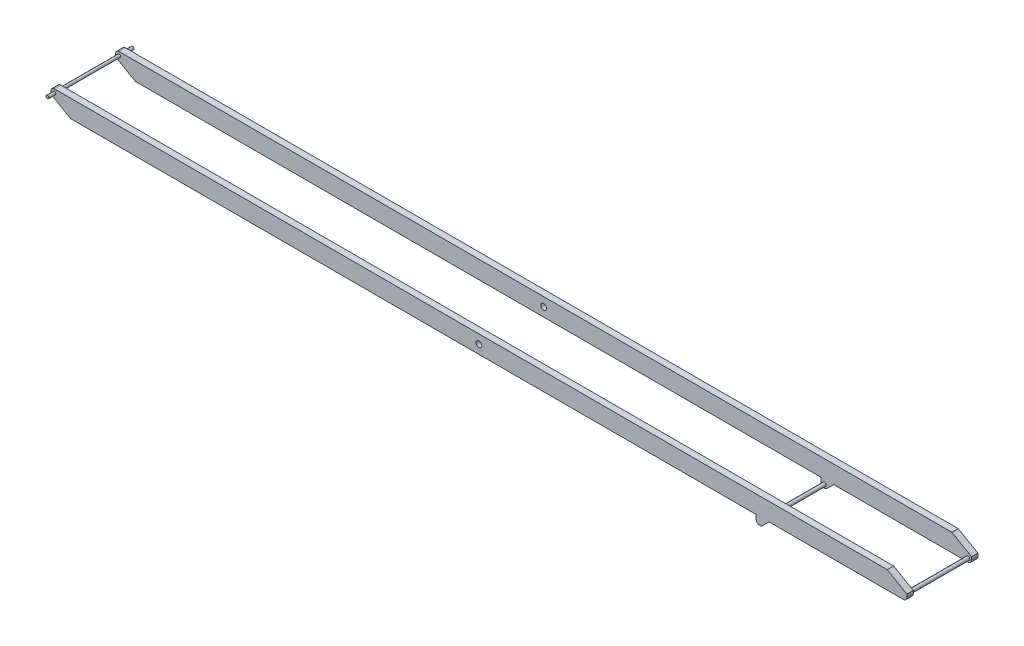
from build123d import *

# Parameters (mm, degrees)
ESQUISSE1_R                  = 25
ESQUISSE1_R_2                = 20
EXTRUSION1_DEPTH             = 500
ESQUISSE2_W                  = 13225.758574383
ESQUISSE2_H                  = 820
ENL_V_MAT_EXTRU_1_DEPTH      = 12014.013776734
ESQUISSE3_R                  = 20
EXTRUSION2_DEPTH             = 600
ESQUISSE4_R                  = 25
EXTRUSION3_DEPTH             = 500
ESQUISSE7_R                  = 25
EXTRUSION4_DEPTH             = 500
EXTRUSION5_DEPTH             = 90
EXTRUSION6_DEPTH             = 90
ENL_V_MAT_EXTRU_3_DEPTH      = 12017.65510864
ENL_V_MAT_EXTRU_3_DEPTH_BACK = 12017.65510864
ESQUISSE5_R                  = 40


with BuildPart() as part:
    # Esquisse1 → Extrusion1 (new, symmetric)
    with BuildSketch(Plane.XY):
        with BuildLine():
            Line((50, 0), (50, 40))
            Line((50, 40), (-227.128129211, 200))
            Line((-227.128129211, 200), (-11950, 200))
            ThreePointArc((-11950, 200), (-11985.355339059, 185.355339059), (-12000, 150))
            Line((-12000, 150), (-12000, 110))
            Line((-12000, 110), (-11722.871870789, -50))
            Line((-11722.871870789, -50), (0, -50))
            ThreePointArc((0, -50), (35.355339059, -35.355339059), (50, 0))
        make_face()
        Circle(ESQUISSE1_R, mode=Mode.SUBTRACT)
        with Locations((-11949.05854032, 150)):
            Circle(ESQUISSE1_R_2, mode=Mode.SUBTRACT)
    extrude(amount=EXTRUSION1_DEPTH, both=True)

    # Esquisse2 → Enl_v. mat.-Extru.1 (cut, through all)
    with BuildSketch(Plane(origin=(0, 200, 0), x_dir=(1, 0, 0), z_dir=(0, 1, 0))):
        with Locations((-6400.882514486, 0)):
            Rectangle(ESQUISSE2_W, ESQUISSE2_H)
    extrude(amount=-ENL_V_MAT_EXTRU_1_DEPTH, mode=Mode.SUBTRACT)


with BuildPart() as enl_v_mat_extru_1_piece_1:
    # of the separate pieces the step leaves, piece 1, a body of its own (enl_v_mat_extru_1_pieces)
    add(part.part.solids().sort_by_distance((0, -50, 500))[0])



with BuildPart() as enl_v_mat_extru_1_piece_2:
    # of the separate pieces the step leaves, piece 2, a body of its own (enl_v_mat_extru_1_pieces)
    add(part.part.solids().sort_by_distance((0, -50, -410))[0])


with BuildPart() as enl_v_mat_extru_1_piece_1_1:
    add(enl_v_mat_extru_1_piece_1.part)

    add(enl_v_mat_extru_1_piece_2.part)  # Extrusion2 merges Enl_v. mat.-Extru.1 piece 2
    # Esquisse3 → Extrusion2 (add, symmetric)
    with BuildSketch(Plane.XY):
        with Locations(Location((-11949.05854032, 150, 0), (0, 0, 180))):
            Circle(ESQUISSE3_R)
    extrude(amount=EXTRUSION2_DEPTH, both=True)

    # Esquisse4 → Extrusion3 (add, symmetric)
    with BuildSketch(Plane.XY):
        with Locations(Location((0, 0, 0), (0, 0, 180))):
            Circle(ESQUISSE4_R)
    extrude(amount=EXTRUSION3_DEPTH, both=True)



with BuildPart() as body_2:
    # Esquisse7 → Extrusion4 (new, symmetric)
    with BuildSketch(Plane.XY):
        with Locations((-2022.010138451, -110)):
            Circle(ESQUISSE7_R)
    extrude(amount=EXTRUSION4_DEPTH, both=True)


with BuildPart() as enl_v_mat_extru_1_piece_1_2:
    add(enl_v_mat_extru_1_piece_1_1.part)

    add(body_2.part)  # Extrusion5 merges body 2
    # Esquisse8 → Extrusion5 (add)
    with BuildSketch(Plane.XY.offset(500)):
        with BuildLine():
            Line((-2072.010138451, -110), (-2072.010138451, -36.383863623))
            Line((-2072.010138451, -36.383863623), (-1876.875897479, -36.383863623))
            Line((-1876.875897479, -36.383863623), (-1986.785460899, -145.48551946))
            ThreePointArc((-1986.785460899, -145.48551946), (-2041.229479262, -156.158606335), (-2072.010138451, -110))
        make_face()
    extrude(amount=-EXTRUSION5_DEPTH)

    # Esquisse9 → Extrusion6 (add)
    with BuildSketch(Plane(origin=(0, 0, -500), x_dir=(-1, 0, 0), z_dir=(0, 0, -1))):
        with BuildLine():
            Line((11722.871870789, -50), (12000, 110))
            Line((12000, 110), (12000, 150))
            ThreePointArc((12000, 150), (11985.355339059, 185.355339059), (11950, 200))
            Line((11950, 200), (227.128129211, 200))
            Line((227.128129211, 200), (-50, 40))
            Line((-50, 40), (-50, 0))
            ThreePointArc((-50, 0), (-35.355339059, -35.355339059), (0, -50))
            Line((0, -50), (1890.592862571, -50))
            Line((1890.592862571, -50), (1986.785460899, -145.48551946))
            ThreePointArc((1986.785460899, -145.48551946), (2041.229479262, -156.158606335), (2072.010138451, -110))
            Line((2072.010138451, -110), (2072.010138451, -50))
            Line((2072.010138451, -50), (11722.871870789, -50))
        make_face()
    extrude(amount=-EXTRUSION6_DEPTH)

    # Esquisse5 → Enl_v. mat.-Extru.3 (cut, two sides: drawn at the far end of the back side and taken through both)
    with BuildSketch(Plane.XY.offset(-ENL_V_MAT_EXTRU_3_DEPTH_BACK)):
        with Locations((-5974.52927016, 75)):
            Circle(ESQUISSE5_R)
    extrude(amount=ENL_V_MAT_EXTRU_3_DEPTH + ENL_V_MAT_EXTRU_3_DEPTH_BACK, mode=Mode.SUBTRACT)


solid = enl_v_mat_extru_1_piece_1_2.part
